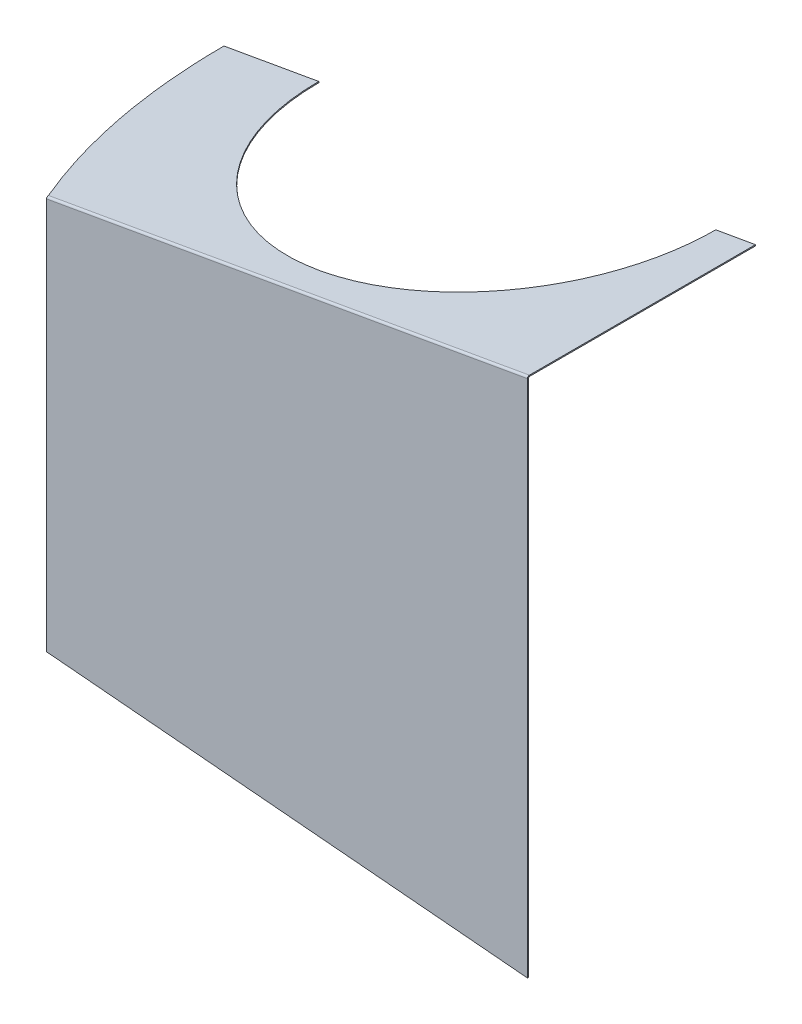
ISO-10303-21;
HEADER;
FILE_DESCRIPTION(('STEP AP214'),'2;1');
FILE_NAME('part.step','',(''),(''),'','','');
FILE_SCHEMA(('AUTOMOTIVE_DESIGN { 1 0 10303 214 1 1 1 1 }'));
ENDSEC;
DATA;
#1=APPLICATION_CONTEXT('core data for automotive mechanical design processes');
#2=APPLICATION_PROTOCOL_DEFINITION('international standard','automotive_design',2000,#1);
#3=PRODUCT_CONTEXT('',#1,'mechanical');
#4=PRODUCT('Part','Part','',(#3));
#5=PRODUCT_RELATED_PRODUCT_CATEGORY('part','',(#4));
#6=PRODUCT_DEFINITION_FORMATION('','',#4);
#7=PRODUCT_DEFINITION_CONTEXT('part definition',#1,'design');
#8=PRODUCT_DEFINITION('design','',#6,#7);
#9=PRODUCT_DEFINITION_SHAPE('','',#8);
#10=(LENGTH_UNIT() NAMED_UNIT(*) SI_UNIT(.MILLI.,.METRE.));
#11=(NAMED_UNIT(*) PLANE_ANGLE_UNIT() SI_UNIT($,.RADIAN.));
#12=(NAMED_UNIT(*) SI_UNIT($,.STERADIAN.) SOLID_ANGLE_UNIT());
#13=UNCERTAINTY_MEASURE_WITH_UNIT(LENGTH_MEASURE(1.E-05),#10,'distance_accuracy_value','');
#14=(GEOMETRIC_REPRESENTATION_CONTEXT(3) GLOBAL_UNCERTAINTY_ASSIGNED_CONTEXT((#13)) GLOBAL_UNIT_ASSIGNED_CONTEXT((#10,
#11,#12)) REPRESENTATION_CONTEXT('',''));
#15=CARTESIAN_POINT('',(0.,0.,0.));
#16=DIRECTION('',(0.,0.,1.));
#17=DIRECTION('',(1.,0.,0.));
#18=AXIS2_PLACEMENT_3D('',#15,#16,#17);
#19=CARTESIAN_POINT('',(0.,525.,0.25));
#20=DIRECTION('',(0.984807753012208,0.17364817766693,0.));
#21=DIRECTION('',(0.,0.,-1.));
#22=AXIS2_PLACEMENT_3D('',#19,#20,#21);
#23=PLANE('',#22);
#24=DIRECTION('',(-0.17364817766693,0.984807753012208,0.));
#25=VECTOR('',#24,1.);
#26=CARTESIAN_POINT('',(0.,525.,228.));
#27=LINE('',#26,#25);
#28=CARTESIAN_POINT('',(0.17364817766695,524.015192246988,228.));
#29=VERTEX_POINT('',#28);
#30=CARTESIAN_POINT('',(0.,525.,228.));
#31=VERTEX_POINT('',#30);
#32=EDGE_CURVE('E13',#29,#31,#27,.T.);
#33=ORIENTED_EDGE('',*,*,#32,.F.);
#34=DIRECTION('',(0.,0.,1.));
#35=VECTOR('',#34,1.);
#36=CARTESIAN_POINT('',(0.173648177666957,524.015192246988,0.25));
#37=LINE('',#36,#35);
#38=CARTESIAN_POINT('',(0.17364817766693,524.015192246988,0.25));
#39=VERTEX_POINT('',#38);
#40=EDGE_CURVE('E111',#29,#39,#37,.F.);
#41=ORIENTED_EDGE('',*,*,#40,.T.);
#42=DIRECTION('',(-0.17364817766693,0.984807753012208,0.));
#43=VECTOR('',#42,1.);
#44=CARTESIAN_POINT('',(0.,525.,0.25));
#45=LINE('',#44,#43);
#46=CARTESIAN_POINT('',(0.,525.,0.25));
#47=VERTEX_POINT('',#46);
#48=EDGE_CURVE('E66',#39,#47,#45,.T.);
#49=ORIENTED_EDGE('',*,*,#48,.T.);
#50=DIRECTION('',(0.,0.,-1.));
#51=VECTOR('',#50,1.);
#52=CARTESIAN_POINT('',(0.,525.,0.25));
#53=LINE('',#52,#51);
#54=EDGE_CURVE('E113',#31,#47,#53,.T.);
#55=ORIENTED_EDGE('',*,*,#54,.F.);
#56=EDGE_LOOP('',(#33,#41,#49,#55));
#57=FACE_BOUND('',#56,.T.);
#58=ADVANCED_FACE('F54',(#57),#23,.T.);
#59=CARTESIAN_POINT('',(0.,525.,0.25));
#60=DIRECTION('',(0.,0.,1.));
#61=DIRECTION('',(0.984807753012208,0.17364817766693,0.));
#62=AXIS2_PLACEMENT_3D('',#59,#60,#61);
#63=PLANE('',#62);
#64=ORIENTED_EDGE('',*,*,#48,.F.);
#65=DIRECTION('',(-0.984807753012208,-0.17364817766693,0.));
#66=VECTOR('',#65,1.);
#67=CARTESIAN_POINT('',(0.17364817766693,524.015192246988,0.25));
#68=LINE('',#67,#66);
#69=CARTESIAN_POINT('',(-39.8263518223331,516.962113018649,0.250000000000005));
#70=VERTEX_POINT('',#69);
#71=EDGE_CURVE('E140',#39,#70,#68,.T.);
#72=ORIENTED_EDGE('',*,*,#71,.T.);
#73=DIRECTION('',(-0.17364817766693,0.984807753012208,0.));
#74=VECTOR('',#73,1.);
#75=CARTESIAN_POINT('',(-40.,517.946920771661,0.250000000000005));
#76=LINE('',#75,#74);
#77=CARTESIAN_POINT('',(-40.,517.946920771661,0.250000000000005));
#78=VERTEX_POINT('',#77);
#79=EDGE_CURVE('E349',#70,#78,#76,.T.);
#80=ORIENTED_EDGE('',*,*,#79,.T.);
#81=DIRECTION('',(0.984807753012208,0.17364817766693,0.));
#82=VECTOR('',#81,1.);
#83=CARTESIAN_POINT('',(0.,525.,0.25));
#84=LINE('',#83,#82);
#85=EDGE_CURVE('E320',#47,#78,#84,.F.);
#86=ORIENTED_EDGE('',*,*,#85,.F.);
#87=EDGE_LOOP('',(#64,#72,#80,#86));
#88=FACE_BOUND('',#87,.T.);
#89=ADVANCED_FACE('F310',(#88),#63,.F.);
#90=CARTESIAN_POINT('',(-240.,482.681524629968,0.250000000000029));
#91=DIRECTION('',(-0.17364817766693,0.984807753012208,0.));
#92=DIRECTION('',(-0.984807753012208,-0.17364817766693,0.));
#93=AXIS2_PLACEMENT_3D('',#90,#91,#92);
#94=ELLIPSE('',#93,203.085322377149,200.);
#95=DIRECTION('',(-0.17364817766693,0.984807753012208,0.));
#96=VECTOR('',#95,1.);
#97=SURFACE_OF_LINEAR_EXTRUSION('',#94,#96);
#98=ORIENTED_EDGE('',*,*,#79,.F.);
#99=CARTESIAN_POINT('',(-239.826351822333,481.696716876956,0.250000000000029));
#100=DIRECTION('',(-0.17364817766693,0.984807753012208,0.));
#101=DIRECTION('',(-0.984807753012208,-0.17364817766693,0.));
#102=AXIS2_PLACEMENT_3D('',#99,#100,#101);
#103=ELLIPSE('',#102,203.085322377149,200.);
#104=CARTESIAN_POINT('',(-439.826351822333,446.431320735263,0.250000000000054));
#105=VERTEX_POINT('',#104);
#106=EDGE_CURVE('E152',#105,#70,#103,.T.);
#107=ORIENTED_EDGE('',*,*,#106,.F.);
#108=DIRECTION('',(-0.17364817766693,0.984807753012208,0.));
#109=VECTOR('',#108,1.);
#110=CARTESIAN_POINT('',(-440.,447.416128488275,0.250000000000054));
#111=LINE('',#110,#109);
#112=CARTESIAN_POINT('',(-440.,447.416128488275,0.250000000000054));
#113=VERTEX_POINT('',#112);
#114=EDGE_CURVE('E353',#105,#113,#111,.T.);
#115=ORIENTED_EDGE('',*,*,#114,.T.);
#116=EDGE_CURVE('E314',#113,#78,#94,.T.);
#117=ORIENTED_EDGE('',*,*,#116,.T.);
#118=EDGE_LOOP('',(#98,#107,#115,#117));
#119=FACE_BOUND('',#118,.T.);
#120=ADVANCED_FACE('F309',(#119),#97,.F.);
#121=ORIENTED_EDGE('',*,*,#114,.F.);
#122=DIRECTION('',(-0.984807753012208,-0.17364817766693,0.));
#123=VECTOR('',#122,1.);
#124=CARTESIAN_POINT('',(0.17364817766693,524.015192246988,0.250000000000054));
#125=LINE('',#124,#123);
#126=CARTESIAN_POINT('',(-535.341985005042,429.589337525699,0.250000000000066));
#127=VERTEX_POINT('',#126);
#128=EDGE_CURVE('E148',#105,#127,#125,.T.);
#129=ORIENTED_EDGE('',*,*,#128,.T.);
#130=CARTESIAN_POINT('',(-535.515633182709,430.574145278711,0.25));
#131=CARTESIAN_POINT('',(-535.341985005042,429.589337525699,0.25));
#132=B_SPLINE_CURVE_WITH_KNOTS('',1,(#130,#131),.UNSPECIFIED.,.F.,.F.,(2,2),(0.,1.),.UNSPECIFIED.);
#133=CARTESIAN_POINT('',(-535.515633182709,430.574145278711,0.250000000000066));
#134=VERTEX_POINT('',#133);
#135=EDGE_CURVE('E294',#127,#134,#132,.F.);
#136=ORIENTED_EDGE('',*,*,#135,.T.);
#137=EDGE_CURVE('E319',#113,#134,#84,.F.);
#138=ORIENTED_EDGE('',*,*,#137,.F.);
#139=EDGE_LOOP('',(#121,#129,#136,#138));
#140=FACE_BOUND('',#139,.T.);
#141=ADVANCED_FACE('F300',(#140),#63,.F.);
#142=CARTESIAN_POINT('',(-535.515633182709,430.574145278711,0.25));
#143=CARTESIAN_POINT('',(-535.506461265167,430.575762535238,19.8755041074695));
#144=CARTESIAN_POINT('',(-534.40758917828,430.769523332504,39.4966383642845));
#145=CARTESIAN_POINT('',(-530.084002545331,431.531888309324,78.4999512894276));
#146=CARTESIAN_POINT('',(-526.858969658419,432.100548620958,97.8808493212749));
#147=CARTESIAN_POINT('',(-518.288306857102,433.611787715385,136.153900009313));
#148=CARTESIAN_POINT('',(-512.942529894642,434.554392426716,155.045716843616));
#149=CARTESIAN_POINT('',(-500.240386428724,436.794123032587,192.113982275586));
#150=CARTESIAN_POINT('',(-492.883925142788,438.091265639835,210.292141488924));
#151=CARTESIAN_POINT('',(-484.551428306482,439.560509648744,228.));
#152=CARTESIAN_POINT('',(-535.341985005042,429.589337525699,0.25));
#153=CARTESIAN_POINT('',(-535.3328130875,429.590954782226,19.8755041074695));
#154=CARTESIAN_POINT('',(-534.233941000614,429.784715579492,39.4966383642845));
#155=CARTESIAN_POINT('',(-529.910354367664,430.547080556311,78.4999512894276));
#156=CARTESIAN_POINT('',(-526.685321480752,431.115740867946,97.8808493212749));
#157=CARTESIAN_POINT('',(-518.114658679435,432.626979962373,136.153900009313));
#158=CARTESIAN_POINT('',(-512.768881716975,433.569584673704,155.045716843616));
#159=CARTESIAN_POINT('',(-500.066738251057,435.809315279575,192.113982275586));
#160=CARTESIAN_POINT('',(-492.710276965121,437.106457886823,210.292141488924));
#161=CARTESIAN_POINT('',(-484.377780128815,438.575701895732,228.));
#162=B_SPLINE_SURFACE_WITH_KNOTS('',1,3,((#142,#143,#144,#145,#146,#147,#148,#149,#150,#151),
(#152,#153,#154,#155,#156,#157,#158,#159,#160,#161)),.UNSPECIFIED.,.F.,.F.,.F.,(2,2),(4,2,2,2,
4),(0.,1.),(0.,0.0588759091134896,0.117751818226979,0.176627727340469,0.235503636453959),.UNSPECIFIED.);
#163=CARTESIAN_POINT('',(-535.341985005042,429.589337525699,0.25));
#164=CARTESIAN_POINT('',(-535.3328130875,429.590954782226,19.8755041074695));
#165=CARTESIAN_POINT('',(-534.233941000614,429.784715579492,39.4966383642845));
#166=CARTESIAN_POINT('',(-529.910354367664,430.547080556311,78.4999512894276));
#167=CARTESIAN_POINT('',(-526.685321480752,431.115740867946,97.8808493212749));
#168=CARTESIAN_POINT('',(-518.114658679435,432.626979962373,136.153900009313));
#169=CARTESIAN_POINT('',(-512.768881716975,433.569584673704,155.045716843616));
#170=CARTESIAN_POINT('',(-500.066738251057,435.809315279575,192.113982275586));
#171=CARTESIAN_POINT('',(-492.710276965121,437.106457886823,210.292141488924));
#172=CARTESIAN_POINT('',(-484.377780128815,438.575701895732,228.));
#173=B_SPLINE_CURVE_WITH_KNOTS('',3,(#163,#164,#165,#166,#167,#168,#169,#170,#171,#172),
.UNSPECIFIED.,.F.,.F.,(4,2,2,2,4),(0.,0.0588759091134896,0.117751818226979,0.176627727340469,
0.235503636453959),.UNSPECIFIED.);
#174=CARTESIAN_POINT('',(-484.377780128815,438.575701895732,228.));
#175=VERTEX_POINT('',#174);
#176=EDGE_CURVE('E134',#127,#175,#173,.T.);
#177=CARTESIAN_POINT('',(-484.377780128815,438.575701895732,228.));
#178=CARTESIAN_POINT('',(-484.551428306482,439.560509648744,228.));
#179=B_SPLINE_CURVE_WITH_KNOTS('',1,(#177,#178),.UNSPECIFIED.,.F.,.F.,(2,2),(0.,1.),.UNSPECIFIED.);
#180=CARTESIAN_POINT('',(-484.551428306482,439.560509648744,228.));
#181=VERTEX_POINT('',#180);
#182=EDGE_CURVE('E272',#175,#181,#179,.T.);
#183=CARTESIAN_POINT('',(-484.551428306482,439.560509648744,228.));
#184=CARTESIAN_POINT('',(-492.883925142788,438.091265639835,210.292141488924));
#185=CARTESIAN_POINT('',(-500.240386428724,436.794123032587,192.113982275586));
#186=CARTESIAN_POINT('',(-512.942529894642,434.554392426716,155.045716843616));
#187=CARTESIAN_POINT('',(-518.288306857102,433.611787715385,136.153900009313));
#188=CARTESIAN_POINT('',(-526.858969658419,432.100548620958,97.8808493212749));
#189=CARTESIAN_POINT('',(-530.084002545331,431.531888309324,78.4999512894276));
#190=CARTESIAN_POINT('',(-534.40758917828,430.769523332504,39.4966383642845));
#191=CARTESIAN_POINT('',(-535.506461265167,430.575762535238,19.8755041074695));
#192=CARTESIAN_POINT('',(-535.515633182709,430.574145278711,0.25));
#193=B_SPLINE_CURVE_WITH_KNOTS('',3,(#183,#184,#185,#186,#187,#188,#189,#190,#191,#192),
.UNSPECIFIED.,.F.,.F.,(4,2,2,2,4),(0.,0.0588759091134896,0.117751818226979,0.176627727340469,
0.235503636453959),.UNSPECIFIED.);
#194=EDGE_CURVE('E328',#134,#181,#193,.F.);
#195=ORIENTED_EDGE('',*,*,#135,.F.);
#196=ORIENTED_EDGE('',*,*,#176,.T.);
#197=ORIENTED_EDGE('',*,*,#182,.T.);
#198=ORIENTED_EDGE('',*,*,#194,.F.);
#199=EDGE_LOOP('',(#195,#196,#197,#198));
#200=FACE_BOUND('',#199,.T.);
#201=ADVANCED_FACE('F226',(#200),#162,.T.);
#202=CARTESIAN_POINT('',(-484.698101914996,437.503793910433,230.));
#203=CARTESIAN_POINT('',(-484.698101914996,437.742841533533,230.));
#204=CARTESIAN_POINT('',(-484.666718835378,438.013995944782,229.956158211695));
#205=CARTESIAN_POINT('',(-484.60361279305,438.408219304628,229.803893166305));
#206=CARTESIAN_POINT('',(-484.579869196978,438.537419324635,229.739152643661));
#207=CARTESIAN_POINT('',(-484.532060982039,438.781097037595,229.583931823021));
#208=CARTESIAN_POINT('',(-484.507987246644,438.895523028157,229.493474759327));
#209=CARTESIAN_POINT('',(-484.443364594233,439.203734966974,229.192375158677));
#210=CARTESIAN_POINT('',(-484.410058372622,439.360436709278,228.951595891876));
#211=CARTESIAN_POINT('',(-484.41322909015,439.547537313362,228.462651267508));
#212=CARTESIAN_POINT('',(-484.449959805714,439.578401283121,228.215636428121));
#213=CARTESIAN_POINT('',(-484.551428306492,439.560509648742,228.));
#214=CARTESIAN_POINT('',(-484.698101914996,437.503793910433,229.));
#215=CARTESIAN_POINT('',(-484.677659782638,437.626936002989,229.));
#216=CARTESIAN_POINT('',(-484.62356714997,437.769270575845,228.978079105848));
#217=CARTESIAN_POINT('',(-484.52770446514,437.977721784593,228.901946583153));
#218=CARTESIAN_POINT('',(-484.493271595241,438.04629992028,228.869576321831));
#219=CARTESIAN_POINT('',(-484.42534850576,438.175900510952,228.79196591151));
#220=CARTESIAN_POINT('',(-484.391853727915,438.236897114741,228.746737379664));
#221=CARTESIAN_POINT('',(-484.301851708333,438.401175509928,228.596187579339));
#222=CARTESIAN_POINT('',(-484.255648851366,438.484736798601,228.475797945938));
#223=CARTESIAN_POINT('',(-484.242773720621,438.580836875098,228.231325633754));
#224=CARTESIAN_POINT('',(-484.27625199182,438.593604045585,228.107881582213));
#225=CARTESIAN_POINT('',(-484.377780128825,438.57570189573,228.));
#226=B_SPLINE_SURFACE_WITH_KNOTS('',1,3,((#202,#203,#204,#205,#206,#207,#208,#209,#210,#211,
#212,#213),(#214,#215,#216,#217,#218,#219,#220,#221,#222,#223,#224,#225)),.UNSPECIFIED.,.F.,.F.,
.F.,(2,2),(4,2,2,2,2,4),(0.,1.),(0.,0.25,0.375,0.5,0.75,1.),.UNSPECIFIED.);
#227=CARTESIAN_POINT('',(-484.377780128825,438.57570189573,228.));
#228=CARTESIAN_POINT('',(-484.27625199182,438.593604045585,228.107881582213));
#229=CARTESIAN_POINT('',(-484.242773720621,438.580836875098,228.231325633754));
#230=CARTESIAN_POINT('',(-484.255648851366,438.484736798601,228.475797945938));
#231=CARTESIAN_POINT('',(-484.301851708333,438.401175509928,228.596187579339));
#232=CARTESIAN_POINT('',(-484.391853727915,438.236897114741,228.746737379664));
#233=CARTESIAN_POINT('',(-484.42534850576,438.175900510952,228.79196591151));
#234=CARTESIAN_POINT('',(-484.493271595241,438.04629992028,228.869576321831));
#235=CARTESIAN_POINT('',(-484.52770446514,437.977721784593,228.901946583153));
#236=CARTESIAN_POINT('',(-484.62356714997,437.769270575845,228.978079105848));
#237=CARTESIAN_POINT('',(-484.677659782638,437.626936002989,229.));
#238=CARTESIAN_POINT('',(-484.698101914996,437.503793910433,229.));
#239=B_SPLINE_CURVE_WITH_KNOTS('',3,(#227,#228,#229,#230,#231,#232,#233,#234,#235,#236,#237,
#238),.UNSPECIFIED.,.F.,.F.,(4,2,2,2,2,4),(0.,0.25,0.5,0.625,0.75,1.),.UNSPECIFIED.);
#240=CARTESIAN_POINT('',(-484.698101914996,437.503793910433,229.));
#241=VERTEX_POINT('',#240);
#242=EDGE_CURVE('E128',#175,#241,#239,.T.);
#243=CARTESIAN_POINT('',(-484.698101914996,437.503793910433,229.));
#244=CARTESIAN_POINT('',(-484.698101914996,437.503793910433,230.));
#245=B_SPLINE_CURVE_WITH_KNOTS('',1,(#243,#244),.UNSPECIFIED.,.F.,.F.,(2,2),(0.,1.),.UNSPECIFIED.);
#246=CARTESIAN_POINT('',(-484.698101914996,437.503793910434,230.));
#247=VERTEX_POINT('',#246);
#248=EDGE_CURVE('E259',#241,#247,#245,.T.);
#249=CARTESIAN_POINT('',(-484.698101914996,437.503793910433,230.));
#250=CARTESIAN_POINT('',(-484.698101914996,437.742841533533,230.));
#251=CARTESIAN_POINT('',(-484.666718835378,438.013995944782,229.956158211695));
#252=CARTESIAN_POINT('',(-484.60361279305,438.408219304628,229.803893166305));
#253=CARTESIAN_POINT('',(-484.579869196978,438.537419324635,229.739152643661));
#254=CARTESIAN_POINT('',(-484.532060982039,438.781097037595,229.583931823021));
#255=CARTESIAN_POINT('',(-484.507987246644,438.895523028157,229.493474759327));
#256=CARTESIAN_POINT('',(-484.443364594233,439.203734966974,229.192375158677));
#257=CARTESIAN_POINT('',(-484.410058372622,439.360436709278,228.951595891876));
#258=CARTESIAN_POINT('',(-484.41322909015,439.547537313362,228.462651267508));
#259=CARTESIAN_POINT('',(-484.449959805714,439.578401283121,228.215636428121));
#260=CARTESIAN_POINT('',(-484.551428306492,439.560509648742,228.));
#261=B_SPLINE_CURVE_WITH_KNOTS('',3,(#249,#250,#251,#252,#253,#254,#255,#256,#257,#258,#259,
#260),.UNSPECIFIED.,.F.,.F.,(4,2,2,2,2,4),(0.,0.25,0.375,0.5,0.75,1.),.UNSPECIFIED.);
#262=EDGE_CURVE('E206',#181,#247,#261,.F.);
#263=ORIENTED_EDGE('',*,*,#182,.F.);
#264=ORIENTED_EDGE('',*,*,#242,.T.);
#265=ORIENTED_EDGE('',*,*,#248,.T.);
#266=ORIENTED_EDGE('',*,*,#262,.F.);
#267=EDGE_LOOP('',(#263,#264,#265,#266));
#268=FACE_BOUND('',#267,.T.);
#269=ADVANCED_FACE('F213',(#268),#226,.F.);
#270=CARTESIAN_POINT('',(-484.698101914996,490.,230.));
#271=DIRECTION('',(1.,0.,0.));
#272=DIRECTION('',(0.,-1.,0.));
#273=AXIS2_PLACEMENT_3D('',#270,#271,#272);
#274=PLANE('',#273);
#275=ORIENTED_EDGE('',*,*,#248,.F.);
#276=DIRECTION('',(0.,1.,0.));
#277=VECTOR('',#276,1.);
#278=CARTESIAN_POINT('',(-484.698101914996,525.,229.));
#279=LINE('',#278,#277);
#280=CARTESIAN_POINT('',(-484.698101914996,42.4055891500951,229.));
#281=VERTEX_POINT('',#280);
#282=EDGE_CURVE('E151',#241,#281,#279,.F.);
#283=ORIENTED_EDGE('',*,*,#282,.T.);
#284=DIRECTION('',(0.,0.,1.));
#285=VECTOR('',#284,1.);
#286=CARTESIAN_POINT('',(-484.698101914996,42.4055891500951,230.));
#287=LINE('',#286,#285);
#288=CARTESIAN_POINT('',(-484.698101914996,42.4055891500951,230.));
#289=VERTEX_POINT('',#288);
#290=EDGE_CURVE('E367',#281,#289,#287,.T.);
#291=ORIENTED_EDGE('',*,*,#290,.T.);
#292=DIRECTION('',(0.,-1.,0.));
#293=VECTOR('',#292,1.);
#294=CARTESIAN_POINT('',(-484.698101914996,490.,230.));
#295=LINE('',#294,#293);
#296=EDGE_CURVE('E168',#247,#289,#295,.T.);
#297=ORIENTED_EDGE('',*,*,#296,.F.);
#298=EDGE_LOOP('',(#275,#283,#291,#297));
#299=FACE_BOUND('',#298,.T.);
#300=ADVANCED_FACE('F225',(#299),#274,.F.);
#301=CARTESIAN_POINT('',(0.,0.,230.));
#302=DIRECTION('',(0.0871557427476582,0.996194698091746,0.));
#303=DIRECTION('',(0.996194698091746,-0.0871557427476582,0.));
#304=AXIS2_PLACEMENT_3D('',#301,#302,#303);
#305=PLANE('',#304);
#306=ORIENTED_EDGE('',*,*,#290,.F.);
#307=DIRECTION('',(0.996194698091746,-0.0871557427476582,0.));
#308=VECTOR('',#307,1.);
#309=CARTESIAN_POINT('',(0.,0.,229.));
#310=LINE('',#309,#308);
#311=CARTESIAN_POINT('',(0.,0.,229.));
#312=VERTEX_POINT('',#311);
#313=EDGE_CURVE('E161',#281,#312,#310,.T.);
#314=ORIENTED_EDGE('',*,*,#313,.T.);
#315=DIRECTION('',(0.,0.,1.));
#316=VECTOR('',#315,1.);
#317=CARTESIAN_POINT('',(0.,0.,230.));
#318=LINE('',#317,#316);
#319=CARTESIAN_POINT('',(0.,0.,230.));
#320=VERTEX_POINT('',#319);
#321=EDGE_CURVE('E369',#312,#320,#318,.T.);
#322=ORIENTED_EDGE('',*,*,#321,.T.);
#323=DIRECTION('',(0.996194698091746,-0.0871557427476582,0.));
#324=VECTOR('',#323,1.);
#325=CARTESIAN_POINT('',(0.,0.,230.));
#326=LINE('',#325,#324);
#327=EDGE_CURVE('E323',#289,#320,#326,.T.);
#328=ORIENTED_EDGE('',*,*,#327,.F.);
#329=EDGE_LOOP('',(#306,#314,#322,#328));
#330=FACE_BOUND('',#329,.T.);
#331=ADVANCED_FACE('F438',(#330),#305,.F.);
#332=CARTESIAN_POINT('',(0.,525.,230.));
#333=DIRECTION('',(1.,0.,0.));
#334=DIRECTION('',(0.,-1.,0.));
#335=AXIS2_PLACEMENT_3D('',#332,#333,#334);
#336=PLANE('',#335);
#337=ORIENTED_EDGE('',*,*,#321,.F.);
#338=DIRECTION('',(0.,1.,0.));
#339=VECTOR('',#338,1.);
#340=CARTESIAN_POINT('',(0.,525.,229.));
#341=LINE('',#340,#339);
#342=CARTESIAN_POINT('',(0.,522.969146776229,229.));
#343=VERTEX_POINT('',#342);
#344=EDGE_CURVE('E330',#343,#312,#341,.F.);
#345=ORIENTED_EDGE('',*,*,#344,.F.);
#346=DIRECTION('',(0.,0.,1.));
#347=VECTOR('',#346,1.);
#348=CARTESIAN_POINT('',(0.,522.969146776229,230.));
#349=LINE('',#348,#347);
#350=CARTESIAN_POINT('',(0.,522.969146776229,230.));
#351=VERTEX_POINT('',#350);
#352=EDGE_CURVE('E60',#343,#351,#349,.T.);
#353=ORIENTED_EDGE('',*,*,#352,.T.);
#354=DIRECTION('',(0.,-1.,0.));
#355=VECTOR('',#354,1.);
#356=CARTESIAN_POINT('',(0.,525.,230.));
#357=LINE('',#356,#355);
#358=EDGE_CURVE('E326',#351,#320,#357,.T.);
#359=ORIENTED_EDGE('',*,*,#358,.T.);
#360=EDGE_LOOP('',(#337,#345,#353,#359));
#361=FACE_BOUND('',#360,.T.);
#362=ADVANCED_FACE('F408',(#361),#336,.T.);
#363=CARTESIAN_POINT('',(-0.173648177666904,521.923101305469,228.));
#364=CARTESIAN_POINT('',(-0.115765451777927,521.594832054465,228.));
#365=CARTESIAN_POINT('',(-0.0578827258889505,521.266562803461,228.));
#366=CARTESIAN_POINT('',(0.,520.938293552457,228.));
#367=CARTESIAN_POINT('',(-0.173648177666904,521.923101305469,230.));
#368=CARTESIAN_POINT('',(-0.115765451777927,521.594832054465,230.666666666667));
#369=CARTESIAN_POINT('',(-0.0578827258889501,521.266562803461,231.333333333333));
#370=CARTESIAN_POINT('',(0.,520.938293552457,232.));
#371=CARTESIAN_POINT('',(0.17364817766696,524.015192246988,230.));
#372=CARTESIAN_POINT('',(0.115765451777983,524.343461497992,230.666666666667));
#373=CARTESIAN_POINT('',(0.0578827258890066,524.671730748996,231.333333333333));
#374=CARTESIAN_POINT('',(0.,525.,232.));
#375=CARTESIAN_POINT('',(0.17364817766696,524.015192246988,228.));
#376=CARTESIAN_POINT('',(0.115765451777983,524.343461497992,228.));
#377=CARTESIAN_POINT('',(0.0578827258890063,524.671730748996,228.));
#378=CARTESIAN_POINT('',(0.,525.,228.));
#379=CARTESIAN_POINT('',(0.17364817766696,524.015192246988,226.));
#380=CARTESIAN_POINT('',(0.115765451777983,524.343461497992,225.333333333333));
#381=CARTESIAN_POINT('',(0.0578827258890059,524.671730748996,224.666666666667));
#382=CARTESIAN_POINT('',(0.,525.,224.));
#383=CARTESIAN_POINT('',(-0.173648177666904,521.923101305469,226.));
#384=CARTESIAN_POINT('',(-0.115765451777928,521.594832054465,225.333333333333));
#385=CARTESIAN_POINT('',(-0.0578827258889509,521.266562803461,224.666666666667));
#386=CARTESIAN_POINT('',(0.,520.938293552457,224.));
#387=CARTESIAN_POINT('',(-0.173648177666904,521.923101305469,228.));
#388=CARTESIAN_POINT('',(-0.115765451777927,521.594832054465,228.));
#389=CARTESIAN_POINT('',(-0.0578827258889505,521.266562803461,228.));
#390=CARTESIAN_POINT('',(0.,520.938293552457,228.));
#391=(BOUNDED_SURFACE() B_SPLINE_SURFACE(3,3,((#363,#364,#365,#366),(#367,#368,#369,#370),(#371,
#372,#373,#374),(#375,#376,#377,#378),(#379,#380,#381,#382),(#383,#384,#385,#386),(#387,#388,
#389,#390)),.UNSPECIFIED.,.T.,.F.,.F.) B_SPLINE_SURFACE_WITH_KNOTS((4,3,4),(4,4),(0.,0.5,1.),
(0.,1.),.UNSPECIFIED.) GEOMETRIC_REPRESENTATION_ITEM() RATIONAL_B_SPLINE_SURFACE(((1.,1.,1.,1.),
(0.333333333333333,0.333333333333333,0.333333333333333,0.333333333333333),(0.333333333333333,
0.333333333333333,0.333333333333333,0.333333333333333),(1.,1.,1.,1.),(0.333333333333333,
0.333333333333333,0.333333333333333,0.333333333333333),(0.333333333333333,0.333333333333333,
0.333333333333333,0.333333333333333),(1.,1.,1.,1.))) REPRESENTATION_ITEM('') SURFACE());
#392=CARTESIAN_POINT('',(0.,522.969146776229,228.));
#393=DIRECTION('',(-0.986499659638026,0.16376330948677,0.));
#394=DIRECTION('',(-0.16376330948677,-0.986499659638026,0.));
#395=AXIS2_PLACEMENT_3D('',#392,#393,#394);
#396=ELLIPSE('',#395,1.06036070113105,1.);
#397=EDGE_CURVE('E126',#343,#29,#396,.T.);
#398=CARTESIAN_POINT('',(0.,522.969146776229,228.));
#399=DIRECTION('',(-1.,0.,0.));
#400=DIRECTION('',(0.,-1.,0.));
#401=AXIS2_PLACEMENT_3D('',#398,#399,#400);
#402=ELLIPSE('',#401,2.03085322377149,2.);
#403=EDGE_CURVE('E156',#351,#31,#402,.T.);
#404=ORIENTED_EDGE('',*,*,#397,.T.);
#405=ORIENTED_EDGE('',*,*,#32,.T.);
#406=ORIENTED_EDGE('',*,*,#403,.F.);
#407=ORIENTED_EDGE('',*,*,#352,.F.);
#408=EDGE_LOOP('',(#404,#405,#406,#407));
#409=FACE_BOUND('',#408,.T.);
#410=ADVANCED_FACE('F56',(#409),#391,.T.);
#411=CARTESIAN_POINT('',(0.,525.,230.));
#412=DIRECTION('',(0.,0.,-1.));
#413=DIRECTION('',(-1.,0.,0.));
#414=AXIS2_PLACEMENT_3D('',#411,#412,#413);
#415=PLANE('',#414);
#416=ORIENTED_EDGE('',*,*,#358,.F.);
#417=DIRECTION('',(-0.984807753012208,-0.17364817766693,0.));
#418=VECTOR('',#417,1.);
#419=CARTESIAN_POINT('',(0.347296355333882,523.030384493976,230.));
#420=LINE('',#419,#418);
#421=EDGE_CURVE('E561',#351,#247,#420,.T.);
#422=ORIENTED_EDGE('',*,*,#421,.T.);
#423=ORIENTED_EDGE('',*,*,#296,.T.);
#424=ORIENTED_EDGE('',*,*,#327,.T.);
#425=EDGE_LOOP('',(#416,#422,#423,#424));
#426=FACE_BOUND('',#425,.T.);
#427=ADVANCED_FACE('F184',(#426),#415,.F.);
#428=CARTESIAN_POINT('',(0.,525.,0.25));
#429=DIRECTION('',(-0.17364817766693,0.984807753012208,0.));
#430=DIRECTION('',(-0.984807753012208,-0.17364817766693,0.));
#431=AXIS2_PLACEMENT_3D('',#428,#429,#430);
#432=PLANE('',#431);
#433=ORIENTED_EDGE('',*,*,#194,.T.);
#434=DIRECTION('',(0.984807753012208,0.17364817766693,0.));
#435=VECTOR('',#434,1.);
#436=CARTESIAN_POINT('',(0.,525.,228.));
#437=LINE('',#436,#435);
#438=EDGE_CURVE('E562',#181,#31,#437,.T.);
#439=ORIENTED_EDGE('',*,*,#438,.T.);
#440=ORIENTED_EDGE('',*,*,#54,.T.);
#441=ORIENTED_EDGE('',*,*,#85,.T.);
#442=ORIENTED_EDGE('',*,*,#116,.F.);
#443=ORIENTED_EDGE('',*,*,#137,.T.);
#444=EDGE_LOOP('',(#433,#439,#440,#441,#442,#443));
#445=FACE_BOUND('',#444,.T.);
#446=ADVANCED_FACE('F182',(#445),#432,.T.);
#447=CARTESIAN_POINT('',(0.347296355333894,523.030384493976,228.));
#448=DIRECTION('',(-0.984807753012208,-0.17364817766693,0.));
#449=DIRECTION('',(0.17364817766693,-0.984807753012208,0.));
#450=AXIS2_PLACEMENT_3D('',#447,#448,#449);
#451=CYLINDRICAL_SURFACE('',#450,2.);
#452=ORIENTED_EDGE('',*,*,#262,.T.);
#453=ORIENTED_EDGE('',*,*,#421,.F.);
#454=ORIENTED_EDGE('',*,*,#403,.T.);
#455=ORIENTED_EDGE('',*,*,#438,.F.);
#456=EDGE_LOOP('',(#452,#453,#454,#455));
#457=FACE_BOUND('',#456,.T.);
#458=ADVANCED_FACE('F171',(#457),#451,.T.);
#459=CARTESIAN_POINT('',(0.,525.,229.));
#460=DIRECTION('',(0.,0.,-1.));
#461=DIRECTION('',(-1.,0.,0.));
#462=AXIS2_PLACEMENT_3D('',#459,#460,#461);
#463=PLANE('',#462);
#464=ORIENTED_EDGE('',*,*,#344,.T.);
#465=ORIENTED_EDGE('',*,*,#313,.F.);
#466=ORIENTED_EDGE('',*,*,#282,.F.);
#467=DIRECTION('',(-0.984807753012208,-0.17364817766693,0.));
#468=VECTOR('',#467,1.);
#469=CARTESIAN_POINT('',(0.347296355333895,523.030384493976,229.));
#470=LINE('',#469,#468);
#471=EDGE_CURVE('E133',#343,#241,#470,.T.);
#472=ORIENTED_EDGE('',*,*,#471,.F.);
#473=EDGE_LOOP('',(#464,#465,#466,#472));
#474=FACE_BOUND('',#473,.T.);
#475=ADVANCED_FACE('F181',(#474),#463,.T.);
#476=CARTESIAN_POINT('',(0.17364817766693,524.015192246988,0.25));
#477=DIRECTION('',(-0.17364817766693,0.984807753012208,0.));
#478=DIRECTION('',(-0.984807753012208,-0.17364817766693,0.));
#479=AXIS2_PLACEMENT_3D('',#476,#477,#478);
#480=PLANE('',#479);
#481=ORIENTED_EDGE('',*,*,#176,.F.);
#482=ORIENTED_EDGE('',*,*,#128,.F.);
#483=ORIENTED_EDGE('',*,*,#106,.T.);
#484=ORIENTED_EDGE('',*,*,#71,.F.);
#485=ORIENTED_EDGE('',*,*,#40,.F.);
#486=DIRECTION('',(-0.984807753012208,-0.17364817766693,0.));
#487=VECTOR('',#486,1.);
#488=CARTESIAN_POINT('',(0.173648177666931,524.015192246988,228.));
#489=LINE('',#488,#487);
#490=EDGE_CURVE('E123',#175,#29,#489,.F.);
#491=ORIENTED_EDGE('',*,*,#490,.F.);
#492=EDGE_LOOP('',(#481,#482,#483,#484,#485,#491));
#493=FACE_BOUND('',#492,.T.);
#494=ADVANCED_FACE('F137',(#493),#480,.F.);
#495=CARTESIAN_POINT('',(0.347296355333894,523.030384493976,228.));
#496=DIRECTION('',(-0.984807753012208,-0.17364817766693,0.));
#497=DIRECTION('',(0.17364817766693,-0.984807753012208,0.));
#498=AXIS2_PLACEMENT_3D('',#495,#496,#497);
#499=CYLINDRICAL_SURFACE('',#498,1.);
#500=ORIENTED_EDGE('',*,*,#242,.F.);
#501=ORIENTED_EDGE('',*,*,#490,.T.);
#502=ORIENTED_EDGE('',*,*,#397,.F.);
#503=ORIENTED_EDGE('',*,*,#471,.T.);
#504=EDGE_LOOP('',(#500,#501,#502,#503));
#505=FACE_BOUND('',#504,.T.);
#506=ADVANCED_FACE('F124',(#505),#499,.F.);
#507=CLOSED_SHELL('',(#58,#89,#120,#141,#201,#269,#300,#331,#362,#410,#427,#446,#458,#475,#494,#506));
#508=MANIFOLD_SOLID_BREP('B2',#507);
#509=ADVANCED_BREP_SHAPE_REPRESENTATION('',(#18,#508),#14);
#510=SHAPE_DEFINITION_REPRESENTATION(#9,#509);
ENDSEC;
END-ISO-10303-21;
